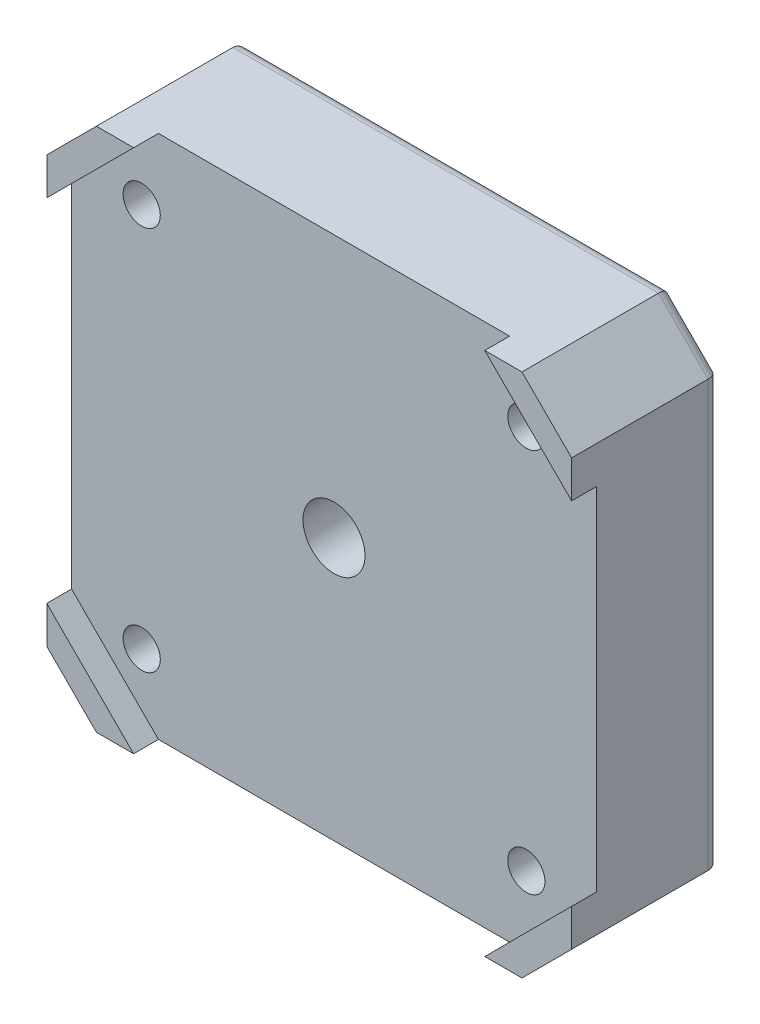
from build123d import *

# Parameters (mm, degrees)
BOSS_EXTRUDE1_DEPTH = 12
CUT_EXTRUDE1_DEPTH  = 2
SKETCH3_R           = 1.5
CUT_EXTRUDE2_DEPTH  = 32.537992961
SKETCH4_R           = 3.1
CUT_EXTRUDE3_DEPTH  = 3
FILLET1_R           = 0.5
FILLET2_R           = 1
SKETCH5_R           = 5.5
CUT_EXTRUDE4_DEPTH  = 5
SKETCH6_R           = 2.5
CUT_EXTRUDE5_DEPTH  = 31.718805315
FILLET3_R           = 1


with BuildPart() as part:
    # Sketch1 → Boss-Extrude1 (new body)
    with BuildSketch(Plane.XY):
        Polygon((-21.15, 17.15), (-17.15, 21.15), (17.15, 21.15), (21.15, 17.15), (21.15, -17.15), (17.15, -21.15), (-17.15, -21.15), (-21.15, -17.15), align=None)
    extrude(amount=BOSS_EXTRUDE1_DEPTH)

    # Sketch2 → Cut-Extrude1 (cut)
    with BuildSketch(Plane.XY.offset(12)):
        Polygon((-21.15, 14.15), (-14.15, 21.15), (14.15, 21.15), (21.15, 14.15), (21.15, -14.15), (14.15, -21.15), (-14.15, -21.15), (-21.15, -14.15), align=None)
    extrude(amount=-CUT_EXTRUDE1_DEPTH, mode=Mode.SUBTRACT)

    # Sketch3 → Cut-Extrude2 (cut, through all)
    with BuildSketch(Plane.XY.offset(10)):
        with Locations((-15.5, 15.5)):
            Circle(SKETCH3_R)
        with Locations((15.5, 15.5)):
            Circle(SKETCH3_R)
        with Locations((15.5, -15.5)):
            Circle(SKETCH3_R)
        with Locations((-15.5, -15.5)):
            Circle(SKETCH3_R)
    extrude(amount=-CUT_EXTRUDE2_DEPTH, mode=Mode.SUBTRACT)

    # Sketch4 → Cut-Extrude3 (cut)
    with BuildSketch(Plane(origin=(0, 0, 0), x_dir=(-1, 0, 0), z_dir=(0, 0, -1))):
        with Locations((-15.5, 15.5)):
            Circle(SKETCH4_R)
        with Locations((15.5, 15.5)):
            Circle(SKETCH4_R)
        with Locations((15.5, -15.5)):
            Circle(SKETCH4_R)
        with Locations((-15.5, -15.5)):
            Circle(SKETCH4_R)
    extrude(amount=-CUT_EXTRUDE3_DEPTH, mode=Mode.SUBTRACT)

    # Fillet1
    fillet1_edges = [part.edges().sort_by_distance(p)[0] for p in [
        (18.6, -15.5, 0),
        (18.6, -15.5, 3),
        (-12.4, -15.5, 0),
        (-12.4, -15.5, 3),
        (-12.4, 15.5, 0),
        (-12.4, 15.5, 3),
        (18.6, 15.5, 0),
        (18.6, 15.5, 3),
    ]]
    fillet(fillet1_edges, radius=FILLET1_R)

    # Fillet2
    fillet2_edges = [part.edges().sort_by_distance(p)[0] for p in [
        (-19.15, -19.15, 0),
        (-21.15, 0, 0),
        (-19.15, 19.15, 0),
        (0, 21.15, 0),
        (19.15, 19.15, 0),
        (21.15, 0, 0),
        (19.15, -19.15, 0),
        (0, -21.15, 0),
    ]]
    fillet(fillet2_edges, radius=FILLET2_R)

    # Sketch5 → Cut-Extrude4 (cut)
    with BuildSketch(Plane(origin=(0, 0, 0), x_dir=(-1, 0, 0), z_dir=(0, 0, -1))):
        Circle(SKETCH5_R)
    extrude(amount=-CUT_EXTRUDE4_DEPTH, mode=Mode.SUBTRACT)

    # Sketch6 → Cut-Extrude5 (cut, through all)
    with BuildSketch(Plane(origin=(0, 0, 5), x_dir=(-1, 0, 0), z_dir=(0, 0, -1))):
        Circle(SKETCH6_R)
    extrude(amount=-CUT_EXTRUDE5_DEPTH, mode=Mode.SUBTRACT)

    # Fillet3
    fillet3_edges = [part.edges().sort_by_distance(p)[0] for p in [
        (5.5, 0, 5),
        (5.5, 0, 0),
    ]]
    fillet(fillet3_edges, radius=FILLET3_R)


solid = part.part
